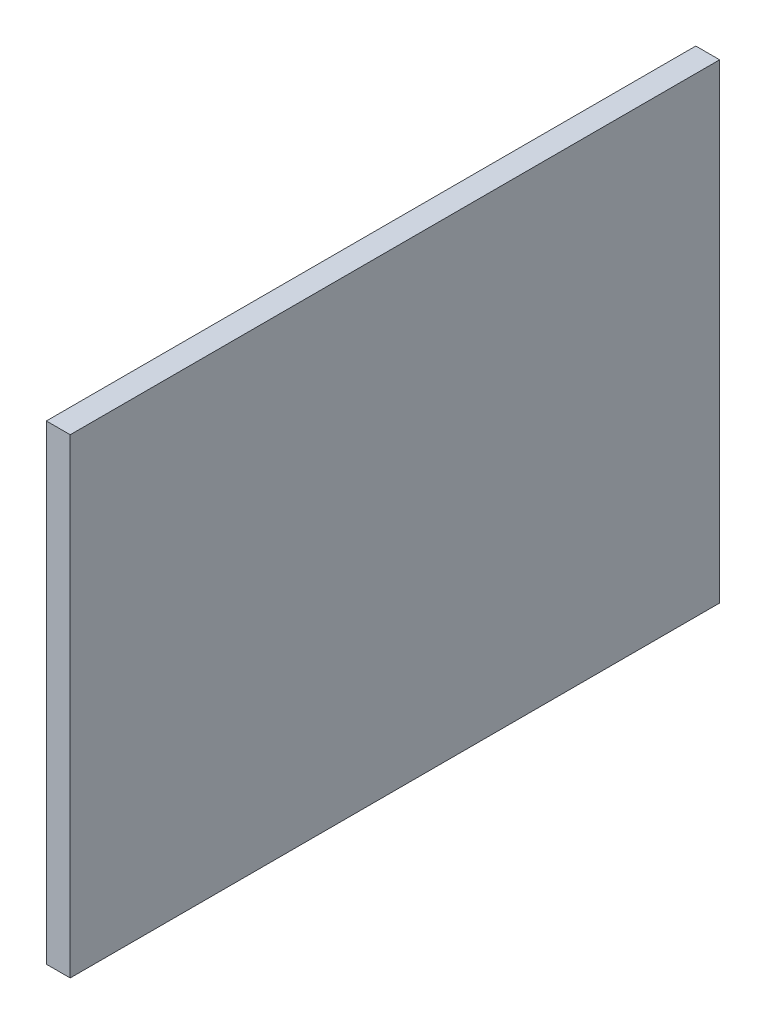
from build123d import *

# Parameters (mm, degrees)
RESSALTO_EXTRUS_O1_DEPTH = 490


with BuildPart() as part:
    # Esbo_o2 → Ressalto-extrus_o1 (new body)
    with BuildSketch(Plane.XY):
        Polygon((263, 1002.65327241), (281, 1002.65327241), (280.978931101, 647.65327241), (263, 647.65327241), align=None)
    extrude(amount=-RESSALTO_EXTRUS_O1_DEPTH)


solid = part.part
